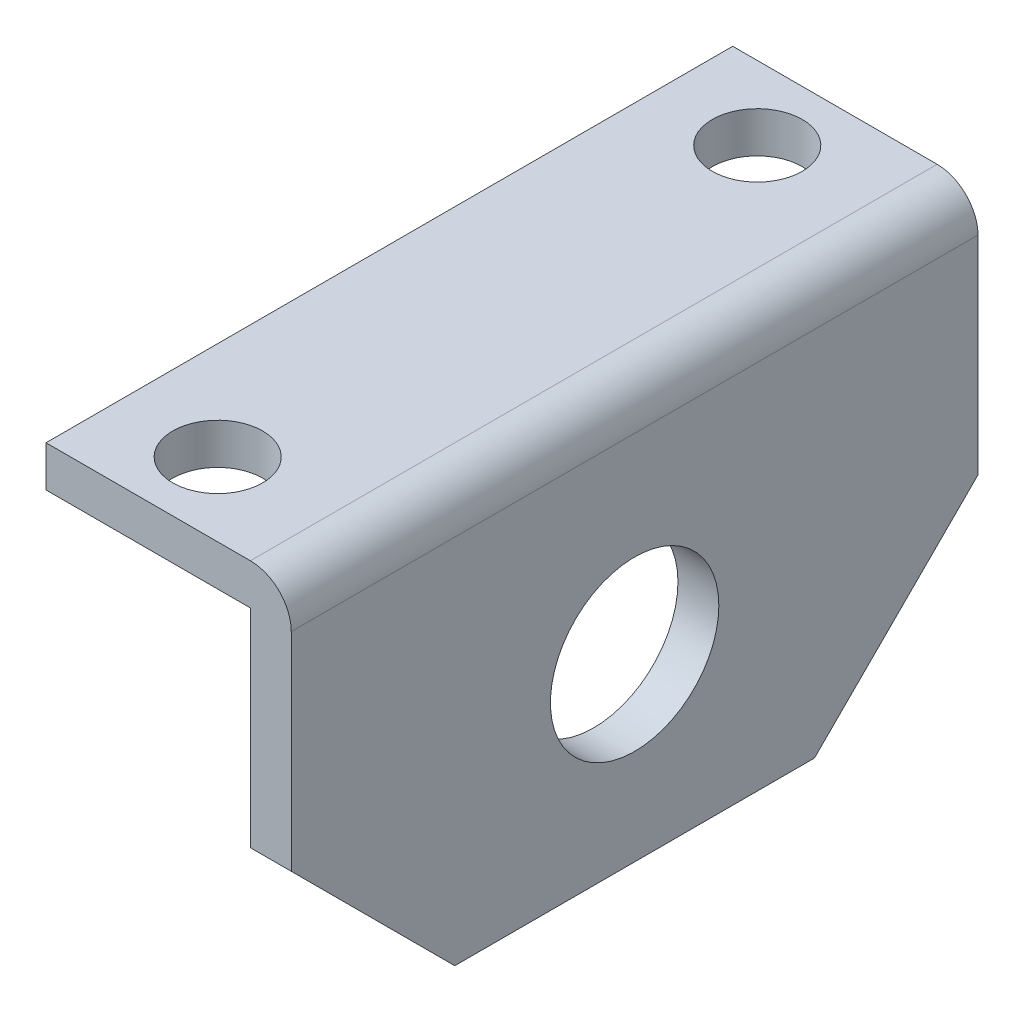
ISO-10303-21;
HEADER;
FILE_DESCRIPTION(('STEP AP214'),'2;1');
FILE_NAME('part.step','',(''),(''),'','','');
FILE_SCHEMA(('AUTOMOTIVE_DESIGN { 1 0 10303 214 1 1 1 1 }'));
ENDSEC;
DATA;
#1=APPLICATION_CONTEXT('core data for automotive mechanical design processes');
#2=APPLICATION_PROTOCOL_DEFINITION('international standard','automotive_design',2000,#1);
#3=PRODUCT_CONTEXT('',#1,'mechanical');
#4=PRODUCT('Part','Part','',(#3));
#5=PRODUCT_RELATED_PRODUCT_CATEGORY('part','',(#4));
#6=PRODUCT_DEFINITION_FORMATION('','',#4);
#7=PRODUCT_DEFINITION_CONTEXT('part definition',#1,'design');
#8=PRODUCT_DEFINITION('design','',#6,#7);
#9=PRODUCT_DEFINITION_SHAPE('','',#8);
#10=(LENGTH_UNIT() NAMED_UNIT(*) SI_UNIT(.MILLI.,.METRE.));
#11=(NAMED_UNIT(*) PLANE_ANGLE_UNIT() SI_UNIT($,.RADIAN.));
#12=(NAMED_UNIT(*) SI_UNIT($,.STERADIAN.) SOLID_ANGLE_UNIT());
#13=UNCERTAINTY_MEASURE_WITH_UNIT(LENGTH_MEASURE(1.E-05),#10,'distance_accuracy_value','');
#14=(GEOMETRIC_REPRESENTATION_CONTEXT(3) GLOBAL_UNCERTAINTY_ASSIGNED_CONTEXT((#13)) GLOBAL_UNIT_ASSIGNED_CONTEXT((#10,
#11,#12)) REPRESENTATION_CONTEXT('',''));
#15=CARTESIAN_POINT('',(0.,0.,0.));
#16=DIRECTION('',(0.,0.,1.));
#17=DIRECTION('',(1.,0.,0.));
#18=AXIS2_PLACEMENT_3D('',#15,#16,#17);
#19=CARTESIAN_POINT('',(12.5,-2.5,42.));
#20=DIRECTION('',(1.,0.,0.));
#21=DIRECTION('',(0.,0.,-1.));
#22=AXIS2_PLACEMENT_3D('',#19,#20,#21);
#23=PLANE('',#22);
#24=CARTESIAN_POINT('',(12.5,-14.1999999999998,21.));
#25=DIRECTION('',(1.,0.,0.));
#26=DIRECTION('',(0.,0.,-1.));
#27=AXIS2_PLACEMENT_3D('',#24,#25,#26);
#28=CIRCLE('',#27,5.15);
#29=CARTESIAN_POINT('',(12.5,-14.1999999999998,15.85));
#30=VERTEX_POINT('',#29);
#31=EDGE_CURVE('E209',#30,#30,#28,.T.);
#32=ORIENTED_EDGE('',*,*,#31,.T.);
#33=EDGE_LOOP('',(#32));
#34=FACE_BOUND('',#33,.T.);
#35=DIRECTION('',(0.,-1.,0.));
#36=VECTOR('',#35,1.);
#37=CARTESIAN_POINT('',(12.5,-2.5,0.));
#38=LINE('',#37,#36);
#39=CARTESIAN_POINT('',(12.5,-2.5,0.));
#40=VERTEX_POINT('',#39);
#41=CARTESIAN_POINT('',(12.5,-15.1999999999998,0.));
#42=VERTEX_POINT('',#41);
#43=EDGE_CURVE('E139',#40,#42,#38,.T.);
#44=ORIENTED_EDGE('',*,*,#43,.T.);
#45=DIRECTION('',(0.,0.707106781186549,-0.707106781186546));
#46=VECTOR('',#45,1.);
#47=CARTESIAN_POINT('',(12.5,-25.1999999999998,10.));
#48=LINE('',#47,#46);
#49=CARTESIAN_POINT('',(12.5,-25.1999999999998,10.));
#50=VERTEX_POINT('',#49);
#51=EDGE_CURVE('E40',#42,#50,#48,.F.);
#52=ORIENTED_EDGE('',*,*,#51,.T.);
#53=DIRECTION('',(0.,0.,-1.));
#54=VECTOR('',#53,1.);
#55=CARTESIAN_POINT('',(12.5,-25.1999999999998,42.));
#56=LINE('',#55,#54);
#57=CARTESIAN_POINT('',(12.5,-25.1999999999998,32.));
#58=VERTEX_POINT('',#57);
#59=EDGE_CURVE('E161',#58,#50,#56,.T.);
#60=ORIENTED_EDGE('',*,*,#59,.F.);
#61=DIRECTION('',(0.,0.707106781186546,0.707106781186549));
#62=VECTOR('',#61,1.);
#63=CARTESIAN_POINT('',(12.5,-15.1999999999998,42.));
#64=LINE('',#63,#62);
#65=CARTESIAN_POINT('',(12.5,-15.1999999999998,42.));
#66=VERTEX_POINT('',#65);
#67=EDGE_CURVE('E47',#58,#66,#64,.T.);
#68=ORIENTED_EDGE('',*,*,#67,.T.);
#69=DIRECTION('',(0.,-1.,0.));
#70=VECTOR('',#69,1.);
#71=CARTESIAN_POINT('',(12.5,-2.5,42.));
#72=LINE('',#71,#70);
#73=CARTESIAN_POINT('',(12.5,-2.5,42.));
#74=VERTEX_POINT('',#73);
#75=EDGE_CURVE('E114',#74,#66,#72,.T.);
#76=ORIENTED_EDGE('',*,*,#75,.F.);
#77=DIRECTION('',(0.,0.,-1.));
#78=VECTOR('',#77,1.);
#79=CARTESIAN_POINT('',(12.5,-2.5,42.));
#80=LINE('',#79,#78);
#81=EDGE_CURVE('E138',#74,#40,#80,.T.);
#82=ORIENTED_EDGE('',*,*,#81,.T.);
#83=EDGE_LOOP('',(#44,#52,#60,#68,#76,#82));
#84=FACE_BOUND('',#83,.T.);
#85=ADVANCED_FACE('F32',(#34,#84),#23,.F.);
#86=CARTESIAN_POINT('',(15.,-25.1999999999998,42.));
#87=DIRECTION('',(0.,1.,0.));
#88=DIRECTION('',(0.,0.,1.));
#89=AXIS2_PLACEMENT_3D('',#86,#87,#88);
#90=PLANE('',#89);
#91=ORIENTED_EDGE('',*,*,#59,.T.);
#92=DIRECTION('',(1.,0.,0.));
#93=VECTOR('',#92,1.);
#94=CARTESIAN_POINT('',(15.,-25.1999999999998,10.));
#95=LINE('',#94,#93);
#96=CARTESIAN_POINT('',(15.,-25.1999999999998,10.));
#97=VERTEX_POINT('',#96);
#98=EDGE_CURVE('E166',#50,#97,#95,.T.);
#99=ORIENTED_EDGE('',*,*,#98,.T.);
#100=DIRECTION('',(0.,0.,-1.));
#101=VECTOR('',#100,1.);
#102=CARTESIAN_POINT('',(15.,-25.1999999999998,42.));
#103=LINE('',#102,#101);
#104=CARTESIAN_POINT('',(15.,-25.1999999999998,32.));
#105=VERTEX_POINT('',#104);
#106=EDGE_CURVE('E123',#105,#97,#103,.T.);
#107=ORIENTED_EDGE('',*,*,#106,.F.);
#108=DIRECTION('',(-1.,0.,0.));
#109=VECTOR('',#108,1.);
#110=CARTESIAN_POINT('',(12.5,-25.1999999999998,32.));
#111=LINE('',#110,#109);
#112=EDGE_CURVE('E164',#105,#58,#111,.T.);
#113=ORIENTED_EDGE('',*,*,#112,.T.);
#114=EDGE_LOOP('',(#91,#99,#107,#113));
#115=FACE_BOUND('',#114,.T.);
#116=ADVANCED_FACE('F178',(#115),#90,.F.);
#117=CARTESIAN_POINT('',(15.,-2.5,42.));
#118=DIRECTION('',(-1.,0.,0.));
#119=DIRECTION('',(0.,0.,1.));
#120=AXIS2_PLACEMENT_3D('',#117,#118,#119);
#121=PLANE('',#120);
#122=CARTESIAN_POINT('',(15.,-14.1999999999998,21.));
#123=DIRECTION('',(1.,0.,0.));
#124=DIRECTION('',(0.,0.,-1.));
#125=AXIS2_PLACEMENT_3D('',#122,#123,#124);
#126=CIRCLE('',#125,5.15);
#127=CARTESIAN_POINT('',(15.,-14.1999999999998,15.85));
#128=VERTEX_POINT('',#127);
#129=EDGE_CURVE('E212',#128,#128,#126,.T.);
#130=ORIENTED_EDGE('',*,*,#129,.F.);
#131=EDGE_LOOP('',(#130));
#132=FACE_BOUND('',#131,.T.);
#133=ORIENTED_EDGE('',*,*,#106,.T.);
#134=DIRECTION('',(0.,-0.707106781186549,0.707106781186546));
#135=VECTOR('',#134,1.);
#136=CARTESIAN_POINT('',(15.,-25.1999999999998,10.));
#137=LINE('',#136,#135);
#138=CARTESIAN_POINT('',(15.,-15.1999999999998,0.));
#139=VERTEX_POINT('',#138);
#140=EDGE_CURVE('E171',#97,#139,#137,.F.);
#141=ORIENTED_EDGE('',*,*,#140,.T.);
#142=DIRECTION('',(0.,1.,0.));
#143=VECTOR('',#142,1.);
#144=CARTESIAN_POINT('',(15.,-2.5,0.));
#145=LINE('',#144,#143);
#146=CARTESIAN_POINT('',(15.,-2.5,0.));
#147=VERTEX_POINT('',#146);
#148=EDGE_CURVE('E120',#139,#147,#145,.T.);
#149=ORIENTED_EDGE('',*,*,#148,.T.);
#150=DIRECTION('',(0.,0.,-1.));
#151=VECTOR('',#150,1.);
#152=CARTESIAN_POINT('',(15.,-2.5,42.));
#153=LINE('',#152,#151);
#154=CARTESIAN_POINT('',(15.,-2.5,42.));
#155=VERTEX_POINT('',#154);
#156=EDGE_CURVE('E117',#155,#147,#153,.T.);
#157=ORIENTED_EDGE('',*,*,#156,.F.);
#158=DIRECTION('',(0.,1.,0.));
#159=VECTOR('',#158,1.);
#160=CARTESIAN_POINT('',(15.,-2.5,42.));
#161=LINE('',#160,#159);
#162=CARTESIAN_POINT('',(15.,-15.1999999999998,42.));
#163=VERTEX_POINT('',#162);
#164=EDGE_CURVE('E106',#163,#155,#161,.T.);
#165=ORIENTED_EDGE('',*,*,#164,.F.);
#166=DIRECTION('',(0.,-0.707106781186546,-0.707106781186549));
#167=VECTOR('',#166,1.);
#168=CARTESIAN_POINT('',(15.,-15.1999999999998,42.));
#169=LINE('',#168,#167);
#170=EDGE_CURVE('E169',#163,#105,#169,.T.);
#171=ORIENTED_EDGE('',*,*,#170,.T.);
#172=EDGE_LOOP('',(#133,#141,#149,#157,#165,#171));
#173=FACE_BOUND('',#172,.T.);
#174=ADVANCED_FACE('F119',(#132,#173),#121,.F.);
#175=CARTESIAN_POINT('',(12.5,-2.5,42.));
#176=DIRECTION('',(0.,0.,-1.));
#177=DIRECTION('',(-1.,0.,0.));
#178=AXIS2_PLACEMENT_3D('',#175,#176,#177);
#179=CYLINDRICAL_SURFACE('',#178,2.5);
#180=CARTESIAN_POINT('',(12.5,-2.5,0.));
#181=DIRECTION('',(0.,0.,1.));
#182=DIRECTION('',(1.,0.,0.));
#183=AXIS2_PLACEMENT_3D('',#180,#181,#182);
#184=CIRCLE('',#183,2.5);
#185=CARTESIAN_POINT('',(12.5,0.,0.));
#186=VERTEX_POINT('',#185);
#187=EDGE_CURVE('E143',#147,#186,#184,.T.);
#188=ORIENTED_EDGE('',*,*,#187,.T.);
#189=DIRECTION('',(0.,0.,-1.));
#190=VECTOR('',#189,1.);
#191=CARTESIAN_POINT('',(12.5,0.,42.));
#192=LINE('',#191,#190);
#193=CARTESIAN_POINT('',(12.5,0.,42.));
#194=VERTEX_POINT('',#193);
#195=EDGE_CURVE('E124',#194,#186,#192,.T.);
#196=ORIENTED_EDGE('',*,*,#195,.F.);
#197=CARTESIAN_POINT('',(12.5,-2.5,42.));
#198=DIRECTION('',(0.,0.,1.));
#199=DIRECTION('',(1.,0.,0.));
#200=AXIS2_PLACEMENT_3D('',#197,#198,#199);
#201=CIRCLE('',#200,2.5);
#202=EDGE_CURVE('E110',#155,#194,#201,.T.);
#203=ORIENTED_EDGE('',*,*,#202,.F.);
#204=ORIENTED_EDGE('',*,*,#156,.T.);
#205=EDGE_LOOP('',(#188,#196,#203,#204));
#206=FACE_BOUND('',#205,.T.);
#207=ADVANCED_FACE('F126',(#206),#179,.T.);
#208=CARTESIAN_POINT('',(0.,0.,42.));
#209=DIRECTION('',(0.,-1.,0.));
#210=DIRECTION('',(0.,0.,-1.));
#211=AXIS2_PLACEMENT_3D('',#208,#209,#210);
#212=PLANE('',#211);
#213=CARTESIAN_POINT('',(6.,0.,4.5));
#214=DIRECTION('',(0.,-1.,0.));
#215=DIRECTION('',(0.,0.,-1.));
#216=AXIS2_PLACEMENT_3D('',#213,#214,#215);
#217=CIRCLE('',#216,2.75);
#218=CARTESIAN_POINT('',(6.,0.,1.75));
#219=VERTEX_POINT('',#218);
#220=EDGE_CURVE('E203',#219,#219,#217,.T.);
#221=ORIENTED_EDGE('',*,*,#220,.T.);
#222=EDGE_LOOP('',(#221));
#223=FACE_BOUND('',#222,.T.);
#224=CARTESIAN_POINT('',(6.,0.,37.5));
#225=DIRECTION('',(0.,-1.,0.));
#226=DIRECTION('',(0.,0.,-1.));
#227=AXIS2_PLACEMENT_3D('',#224,#225,#226);
#228=CIRCLE('',#227,2.75);
#229=CARTESIAN_POINT('',(6.,0.,34.75));
#230=VERTEX_POINT('',#229);
#231=EDGE_CURVE('E141',#230,#230,#228,.T.);
#232=ORIENTED_EDGE('',*,*,#231,.T.);
#233=EDGE_LOOP('',(#232));
#234=FACE_BOUND('',#233,.T.);
#235=DIRECTION('',(-1.,0.,0.));
#236=VECTOR('',#235,1.);
#237=CARTESIAN_POINT('',(0.,0.,0.));
#238=LINE('',#237,#236);
#239=CARTESIAN_POINT('',(0.,0.,0.));
#240=VERTEX_POINT('',#239);
#241=EDGE_CURVE('E145',#186,#240,#238,.T.);
#242=ORIENTED_EDGE('',*,*,#241,.T.);
#243=DIRECTION('',(0.,0.,-1.));
#244=VECTOR('',#243,1.);
#245=CARTESIAN_POINT('',(0.,0.,42.));
#246=LINE('',#245,#244);
#247=CARTESIAN_POINT('',(0.,0.,42.));
#248=VERTEX_POINT('',#247);
#249=EDGE_CURVE('E156',#248,#240,#246,.T.);
#250=ORIENTED_EDGE('',*,*,#249,.F.);
#251=DIRECTION('',(-1.,0.,0.));
#252=VECTOR('',#251,1.);
#253=CARTESIAN_POINT('',(0.,0.,42.));
#254=LINE('',#253,#252);
#255=EDGE_CURVE('E129',#194,#248,#254,.T.);
#256=ORIENTED_EDGE('',*,*,#255,.F.);
#257=ORIENTED_EDGE('',*,*,#195,.T.);
#258=EDGE_LOOP('',(#242,#250,#256,#257));
#259=FACE_BOUND('',#258,.T.);
#260=ADVANCED_FACE('F186',(#223,#234,#259),#212,.F.);
#261=CARTESIAN_POINT('',(0.,0.,42.));
#262=DIRECTION('',(1.,0.,0.));
#263=DIRECTION('',(0.,0.,-1.));
#264=AXIS2_PLACEMENT_3D('',#261,#262,#263);
#265=PLANE('',#264);
#266=DIRECTION('',(0.,-1.,0.));
#267=VECTOR('',#266,1.);
#268=CARTESIAN_POINT('',(0.,0.,0.));
#269=LINE('',#268,#267);
#270=CARTESIAN_POINT('',(0.,-2.5,0.));
#271=VERTEX_POINT('',#270);
#272=EDGE_CURVE('E147',#240,#271,#269,.T.);
#273=ORIENTED_EDGE('',*,*,#272,.T.);
#274=DIRECTION('',(0.,0.,-1.));
#275=VECTOR('',#274,1.);
#276=CARTESIAN_POINT('',(0.,-2.5,42.));
#277=LINE('',#276,#275);
#278=CARTESIAN_POINT('',(0.,-2.5,42.));
#279=VERTEX_POINT('',#278);
#280=EDGE_CURVE('E153',#279,#271,#277,.T.);
#281=ORIENTED_EDGE('',*,*,#280,.F.);
#282=DIRECTION('',(0.,-1.,0.));
#283=VECTOR('',#282,1.);
#284=CARTESIAN_POINT('',(0.,0.,42.));
#285=LINE('',#284,#283);
#286=EDGE_CURVE('E131',#248,#279,#285,.T.);
#287=ORIENTED_EDGE('',*,*,#286,.F.);
#288=ORIENTED_EDGE('',*,*,#249,.T.);
#289=EDGE_LOOP('',(#273,#281,#287,#288));
#290=FACE_BOUND('',#289,.T.);
#291=ADVANCED_FACE('F193',(#290),#265,.F.);
#292=CARTESIAN_POINT('',(0.,-2.5,42.));
#293=DIRECTION('',(0.,1.,0.));
#294=DIRECTION('',(0.,0.,1.));
#295=AXIS2_PLACEMENT_3D('',#292,#293,#294);
#296=PLANE('',#295);
#297=CARTESIAN_POINT('',(6.,-2.5,4.5));
#298=DIRECTION('',(0.,-1.,0.));
#299=DIRECTION('',(0.,0.,-1.));
#300=AXIS2_PLACEMENT_3D('',#297,#298,#299);
#301=CIRCLE('',#300,2.75);
#302=CARTESIAN_POINT('',(6.,-2.5,1.75));
#303=VERTEX_POINT('',#302);
#304=EDGE_CURVE('E206',#303,#303,#301,.T.);
#305=ORIENTED_EDGE('',*,*,#304,.F.);
#306=EDGE_LOOP('',(#305));
#307=FACE_BOUND('',#306,.T.);
#308=CARTESIAN_POINT('',(6.,-2.5,37.5));
#309=DIRECTION('',(0.,-1.,0.));
#310=DIRECTION('',(0.,0.,-1.));
#311=AXIS2_PLACEMENT_3D('',#308,#309,#310);
#312=CIRCLE('',#311,2.75);
#313=CARTESIAN_POINT('',(6.,-2.5,34.75));
#314=VERTEX_POINT('',#313);
#315=EDGE_CURVE('E200',#314,#314,#312,.T.);
#316=ORIENTED_EDGE('',*,*,#315,.F.);
#317=EDGE_LOOP('',(#316));
#318=FACE_BOUND('',#317,.T.);
#319=DIRECTION('',(1.,0.,0.));
#320=VECTOR('',#319,1.);
#321=CARTESIAN_POINT('',(0.,-2.5,0.));
#322=LINE('',#321,#320);
#323=EDGE_CURVE('E149',#271,#40,#322,.T.);
#324=ORIENTED_EDGE('',*,*,#323,.T.);
#325=ORIENTED_EDGE('',*,*,#81,.F.);
#326=DIRECTION('',(1.,0.,0.));
#327=VECTOR('',#326,1.);
#328=CARTESIAN_POINT('',(0.,-2.5,42.));
#329=LINE('',#328,#327);
#330=EDGE_CURVE('E136',#279,#74,#329,.T.);
#331=ORIENTED_EDGE('',*,*,#330,.F.);
#332=ORIENTED_EDGE('',*,*,#280,.T.);
#333=EDGE_LOOP('',(#324,#325,#331,#332));
#334=FACE_BOUND('',#333,.T.);
#335=ADVANCED_FACE('F196',(#307,#318,#334),#296,.F.);
#336=CARTESIAN_POINT('',(12.5,-2.5,42.));
#337=DIRECTION('',(0.,0.,1.));
#338=DIRECTION('',(1.,0.,0.));
#339=AXIS2_PLACEMENT_3D('',#336,#337,#338);
#340=PLANE('',#339);
#341=ORIENTED_EDGE('',*,*,#75,.T.);
#342=DIRECTION('',(1.,0.,0.));
#343=VECTOR('',#342,1.);
#344=CARTESIAN_POINT('',(15.,-15.1999999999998,42.));
#345=LINE('',#344,#343);
#346=EDGE_CURVE('E11',#66,#163,#345,.T.);
#347=ORIENTED_EDGE('',*,*,#346,.T.);
#348=ORIENTED_EDGE('',*,*,#164,.T.);
#349=ORIENTED_EDGE('',*,*,#202,.T.);
#350=ORIENTED_EDGE('',*,*,#255,.T.);
#351=ORIENTED_EDGE('',*,*,#286,.T.);
#352=ORIENTED_EDGE('',*,*,#330,.T.);
#353=EDGE_LOOP('',(#341,#347,#348,#349,#350,#351,#352));
#354=FACE_BOUND('',#353,.T.);
#355=ADVANCED_FACE('F108',(#354),#340,.T.);
#356=CARTESIAN_POINT('',(12.5,-2.5,0.));
#357=DIRECTION('',(0.,0.,1.));
#358=DIRECTION('',(1.,0.,0.));
#359=AXIS2_PLACEMENT_3D('',#356,#357,#358);
#360=PLANE('',#359);
#361=ORIENTED_EDGE('',*,*,#148,.F.);
#362=DIRECTION('',(-1.,0.,0.));
#363=VECTOR('',#362,1.);
#364=CARTESIAN_POINT('',(12.5,-15.1999999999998,0.));
#365=LINE('',#364,#363);
#366=EDGE_CURVE('E55',#139,#42,#365,.T.);
#367=ORIENTED_EDGE('',*,*,#366,.T.);
#368=ORIENTED_EDGE('',*,*,#43,.F.);
#369=ORIENTED_EDGE('',*,*,#323,.F.);
#370=ORIENTED_EDGE('',*,*,#272,.F.);
#371=ORIENTED_EDGE('',*,*,#241,.F.);
#372=ORIENTED_EDGE('',*,*,#187,.F.);
#373=EDGE_LOOP('',(#361,#367,#368,#369,#370,#371,#372));
#374=FACE_BOUND('',#373,.T.);
#375=ADVANCED_FACE('F182',(#374),#360,.F.);
#376=CARTESIAN_POINT('',(6.,39.5,37.5));
#377=DIRECTION('',(0.,-1.,0.));
#378=DIRECTION('',(0.,0.,-1.));
#379=AXIS2_PLACEMENT_3D('',#376,#377,#378);
#380=CYLINDRICAL_SURFACE('',#379,2.75);
#381=CARTESIAN_POINT('',(6.,-2.5,34.75));
#382=CARTESIAN_POINT('',(6.,-2.47395833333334,34.75));
#383=CARTESIAN_POINT('',(6.,-2.44791666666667,34.75));
#384=CARTESIAN_POINT('',(6.,-2.39583333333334,34.75));
#385=CARTESIAN_POINT('',(6.,-2.36979166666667,34.75));
#386=CARTESIAN_POINT('',(6.,-2.31770833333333,34.75));
#387=CARTESIAN_POINT('',(6.,-2.29166666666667,34.75));
#388=CARTESIAN_POINT('',(6.,-2.23958333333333,34.75));
#389=CARTESIAN_POINT('',(6.,-2.21354166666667,34.75));
#390=CARTESIAN_POINT('',(6.,-2.16145833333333,34.75));
#391=CARTESIAN_POINT('',(6.,-2.13541666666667,34.75));
#392=CARTESIAN_POINT('',(6.,-2.08333333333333,34.75));
#393=CARTESIAN_POINT('',(6.,-2.05729166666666,34.75));
#394=CARTESIAN_POINT('',(6.,-2.00520833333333,34.75));
#395=CARTESIAN_POINT('',(6.,-1.97916666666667,34.75));
#396=CARTESIAN_POINT('',(6.,-1.92708333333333,34.75));
#397=CARTESIAN_POINT('',(6.,-1.90104166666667,34.75));
#398=CARTESIAN_POINT('',(6.,-1.84895833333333,34.75));
#399=CARTESIAN_POINT('',(6.,-1.82291666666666,34.75));
#400=CARTESIAN_POINT('',(6.,-1.77083333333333,34.75));
#401=CARTESIAN_POINT('',(6.,-1.74479166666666,34.75));
#402=CARTESIAN_POINT('',(6.,-1.69270833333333,34.75));
#403=CARTESIAN_POINT('',(6.,-1.66666666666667,34.75));
#404=CARTESIAN_POINT('',(6.,-1.61458333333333,34.75));
#405=CARTESIAN_POINT('',(6.,-1.58854166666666,34.75));
#406=CARTESIAN_POINT('',(6.,-1.53645833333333,34.75));
#407=CARTESIAN_POINT('',(6.,-1.51041666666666,34.75));
#408=CARTESIAN_POINT('',(6.,-1.45833333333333,34.75));
#409=CARTESIAN_POINT('',(6.,-1.43229166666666,34.75));
#410=CARTESIAN_POINT('',(6.,-1.38020833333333,34.75));
#411=CARTESIAN_POINT('',(6.,-1.35416666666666,34.75));
#412=CARTESIAN_POINT('',(6.,-1.30208333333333,34.75));
#413=CARTESIAN_POINT('',(6.,-1.27604166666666,34.75));
#414=CARTESIAN_POINT('',(6.,-1.22395833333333,34.75));
#415=CARTESIAN_POINT('',(6.,-1.19791666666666,34.75));
#416=CARTESIAN_POINT('',(6.,-1.14583333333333,34.75));
#417=CARTESIAN_POINT('',(6.,-1.11979166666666,34.75));
#418=CARTESIAN_POINT('',(6.,-1.06770833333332,34.75));
#419=CARTESIAN_POINT('',(6.,-1.04166666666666,34.75));
#420=CARTESIAN_POINT('',(6.,-0.989583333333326,34.75));
#421=CARTESIAN_POINT('',(6.,-0.96354166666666,34.75));
#422=CARTESIAN_POINT('',(6.,-0.911458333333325,34.75));
#423=CARTESIAN_POINT('',(6.,-0.885416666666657,34.75));
#424=CARTESIAN_POINT('',(6.,-0.833333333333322,34.75));
#425=CARTESIAN_POINT('',(6.,-0.807291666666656,34.75));
#426=CARTESIAN_POINT('',(6.,-0.755208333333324,34.75));
#427=CARTESIAN_POINT('',(6.,-0.729166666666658,34.75));
#428=CARTESIAN_POINT('',(6.,-0.677083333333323,34.75));
#429=CARTESIAN_POINT('',(6.,-0.651041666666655,34.75));
#430=CARTESIAN_POINT('',(6.,-0.598958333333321,34.75));
#431=CARTESIAN_POINT('',(6.,-0.572916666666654,34.75));
#432=CARTESIAN_POINT('',(6.,-0.520833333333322,34.75));
#433=CARTESIAN_POINT('',(6.,-0.494791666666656,34.75));
#434=CARTESIAN_POINT('',(6.,-0.442708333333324,34.75));
#435=CARTESIAN_POINT('',(6.,-0.416666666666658,34.75));
#436=CARTESIAN_POINT('',(6.,-0.364583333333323,34.75));
#437=CARTESIAN_POINT('',(6.,-0.338541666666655,34.75));
#438=CARTESIAN_POINT('',(6.,-0.28645833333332,34.75));
#439=CARTESIAN_POINT('',(6.,-0.260416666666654,34.75));
#440=CARTESIAN_POINT('',(6.,-0.208333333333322,34.75));
#441=CARTESIAN_POINT('',(6.,-0.182291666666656,34.75));
#442=CARTESIAN_POINT('',(6.,-0.130208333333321,34.75));
#443=CARTESIAN_POINT('',(6.,-0.104166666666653,34.75));
#444=CARTESIAN_POINT('',(6.,-0.0520833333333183,34.75));
#445=CARTESIAN_POINT('',(6.,-0.0260416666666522,34.75));
#446=CARTESIAN_POINT('',(6.,0.,34.75));
#447=B_SPLINE_CURVE_WITH_KNOTS('',3,(#381,#382,#383,#384,#385,#386,#387,#388,#389,#390,#391,
#392,#393,#394,#395,#396,#397,#398,#399,#400,#401,#402,#403,#404,#405,#406,#407,#408,#409,#410,
#411,#412,#413,#414,#415,#416,#417,#418,#419,#420,#421,#422,#423,#424,#425,#426,#427,#428,#429,
#430,#431,#432,#433,#434,#435,#436,#437,#438,#439,#440,#441,#442,#443,#444,#445,#446),
.UNSPECIFIED.,.F.,.F.,(4,2,2,2,2,2,2,2,2,2,2,2,2,2,2,2,2,2,2,2,2,2,2,2,2,2,2,2,2,2,2,2,4),(0.,
0.0781249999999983,0.156250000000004,0.234375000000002,0.3125,0.390625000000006,
0.468750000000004,0.546875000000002,0.625000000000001,0.703125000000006,0.781250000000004,
0.859375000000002,0.937500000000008,1.01562500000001,1.09375,1.17187500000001,1.25000000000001,
1.32812500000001,1.40625000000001,1.48437500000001,1.56250000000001,1.64062500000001,
1.71875000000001,1.79687500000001,1.87500000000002,1.95312500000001,2.03125000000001,
2.10937500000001,2.18750000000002,2.26562500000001,2.34375000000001,2.42187500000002,
2.50000000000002),.UNSPECIFIED.);
#448=EDGE_CURVE('BSEAM243',#314,#230,#447,.T.);
#449=ORIENTED_EDGE('',*,*,#315,.T.);
#450=ORIENTED_EDGE('',*,*,#231,.F.);
#451=ORIENTED_EDGE('',*,*,#448,.T.);
#452=ORIENTED_EDGE('',*,*,#448,.F.);
#453=EDGE_LOOP('',(#449,#451,#450,#452));
#454=FACE_BOUND('',#453,.T.);
#455=ADVANCED_FACE('F243',(#454),#380,.F.);
#456=CARTESIAN_POINT('',(6.,39.5,4.5));
#457=DIRECTION('',(0.,-1.,0.));
#458=DIRECTION('',(0.,0.,-1.));
#459=AXIS2_PLACEMENT_3D('',#456,#457,#458);
#460=CYLINDRICAL_SURFACE('',#459,2.75);
#461=CARTESIAN_POINT('',(6.,-2.5,1.75));
#462=CARTESIAN_POINT('',(6.,-2.47395833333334,1.75));
#463=CARTESIAN_POINT('',(6.,-2.44791666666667,1.75));
#464=CARTESIAN_POINT('',(6.,-2.39583333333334,1.75));
#465=CARTESIAN_POINT('',(6.,-2.36979166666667,1.75));
#466=CARTESIAN_POINT('',(6.,-2.31770833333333,1.75));
#467=CARTESIAN_POINT('',(6.,-2.29166666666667,1.75));
#468=CARTESIAN_POINT('',(6.,-2.23958333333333,1.75));
#469=CARTESIAN_POINT('',(6.,-2.21354166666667,1.75));
#470=CARTESIAN_POINT('',(6.,-2.16145833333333,1.75));
#471=CARTESIAN_POINT('',(6.,-2.13541666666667,1.75));
#472=CARTESIAN_POINT('',(6.,-2.08333333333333,1.75));
#473=CARTESIAN_POINT('',(6.,-2.05729166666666,1.75));
#474=CARTESIAN_POINT('',(6.,-2.00520833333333,1.75));
#475=CARTESIAN_POINT('',(6.,-1.97916666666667,1.75));
#476=CARTESIAN_POINT('',(6.,-1.92708333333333,1.75));
#477=CARTESIAN_POINT('',(6.,-1.90104166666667,1.75));
#478=CARTESIAN_POINT('',(6.,-1.84895833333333,1.75));
#479=CARTESIAN_POINT('',(6.,-1.82291666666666,1.75));
#480=CARTESIAN_POINT('',(6.,-1.77083333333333,1.75));
#481=CARTESIAN_POINT('',(6.,-1.74479166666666,1.75));
#482=CARTESIAN_POINT('',(6.,-1.69270833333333,1.75));
#483=CARTESIAN_POINT('',(6.,-1.66666666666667,1.75));
#484=CARTESIAN_POINT('',(6.,-1.61458333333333,1.75));
#485=CARTESIAN_POINT('',(6.,-1.58854166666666,1.75));
#486=CARTESIAN_POINT('',(6.,-1.53645833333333,1.75));
#487=CARTESIAN_POINT('',(6.,-1.51041666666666,1.75));
#488=CARTESIAN_POINT('',(6.,-1.45833333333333,1.75));
#489=CARTESIAN_POINT('',(6.,-1.43229166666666,1.75));
#490=CARTESIAN_POINT('',(6.,-1.38020833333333,1.75));
#491=CARTESIAN_POINT('',(6.,-1.35416666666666,1.75));
#492=CARTESIAN_POINT('',(6.,-1.30208333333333,1.75));
#493=CARTESIAN_POINT('',(6.,-1.27604166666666,1.75));
#494=CARTESIAN_POINT('',(6.,-1.22395833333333,1.75));
#495=CARTESIAN_POINT('',(6.,-1.19791666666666,1.75));
#496=CARTESIAN_POINT('',(6.,-1.14583333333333,1.75));
#497=CARTESIAN_POINT('',(6.,-1.11979166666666,1.75));
#498=CARTESIAN_POINT('',(6.,-1.06770833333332,1.75));
#499=CARTESIAN_POINT('',(6.,-1.04166666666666,1.75));
#500=CARTESIAN_POINT('',(6.,-0.989583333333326,1.75));
#501=CARTESIAN_POINT('',(6.,-0.96354166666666,1.75));
#502=CARTESIAN_POINT('',(6.,-0.911458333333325,1.75));
#503=CARTESIAN_POINT('',(6.,-0.885416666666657,1.75));
#504=CARTESIAN_POINT('',(6.,-0.833333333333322,1.75));
#505=CARTESIAN_POINT('',(6.,-0.807291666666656,1.75));
#506=CARTESIAN_POINT('',(6.,-0.755208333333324,1.75));
#507=CARTESIAN_POINT('',(6.,-0.729166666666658,1.75));
#508=CARTESIAN_POINT('',(6.,-0.677083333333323,1.75));
#509=CARTESIAN_POINT('',(6.,-0.651041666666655,1.75));
#510=CARTESIAN_POINT('',(6.,-0.598958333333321,1.75));
#511=CARTESIAN_POINT('',(6.,-0.572916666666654,1.75));
#512=CARTESIAN_POINT('',(6.,-0.520833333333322,1.75));
#513=CARTESIAN_POINT('',(6.,-0.494791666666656,1.75));
#514=CARTESIAN_POINT('',(6.,-0.442708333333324,1.75));
#515=CARTESIAN_POINT('',(6.,-0.416666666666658,1.75));
#516=CARTESIAN_POINT('',(6.,-0.364583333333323,1.75));
#517=CARTESIAN_POINT('',(6.,-0.338541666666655,1.75));
#518=CARTESIAN_POINT('',(6.,-0.28645833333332,1.75));
#519=CARTESIAN_POINT('',(6.,-0.260416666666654,1.75));
#520=CARTESIAN_POINT('',(6.,-0.208333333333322,1.75));
#521=CARTESIAN_POINT('',(6.,-0.182291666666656,1.75));
#522=CARTESIAN_POINT('',(6.,-0.130208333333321,1.75));
#523=CARTESIAN_POINT('',(6.,-0.104166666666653,1.75));
#524=CARTESIAN_POINT('',(6.,-0.0520833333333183,1.75));
#525=CARTESIAN_POINT('',(6.,-0.0260416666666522,1.75));
#526=CARTESIAN_POINT('',(6.,0.,1.75));
#527=B_SPLINE_CURVE_WITH_KNOTS('',3,(#461,#462,#463,#464,#465,#466,#467,#468,#469,#470,#471,
#472,#473,#474,#475,#476,#477,#478,#479,#480,#481,#482,#483,#484,#485,#486,#487,#488,#489,#490,
#491,#492,#493,#494,#495,#496,#497,#498,#499,#500,#501,#502,#503,#504,#505,#506,#507,#508,#509,
#510,#511,#512,#513,#514,#515,#516,#517,#518,#519,#520,#521,#522,#523,#524,#525,#526),
.UNSPECIFIED.,.F.,.F.,(4,2,2,2,2,2,2,2,2,2,2,2,2,2,2,2,2,2,2,2,2,2,2,2,2,2,2,2,2,2,2,2,4),(0.,
0.0781249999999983,0.156250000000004,0.234375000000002,0.3125,0.390625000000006,
0.468750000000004,0.546875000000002,0.625000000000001,0.703125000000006,0.781250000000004,
0.859375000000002,0.937500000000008,1.01562500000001,1.09375,1.17187500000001,1.25000000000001,
1.32812500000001,1.40625000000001,1.48437500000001,1.56250000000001,1.64062500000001,
1.71875000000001,1.79687500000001,1.87500000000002,1.95312500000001,2.03125000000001,
2.10937500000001,2.18750000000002,2.26562500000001,2.34375000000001,2.42187500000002,
2.50000000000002),.UNSPECIFIED.);
#528=EDGE_CURVE('BSEAM238',#303,#219,#527,.T.);
#529=ORIENTED_EDGE('',*,*,#304,.T.);
#530=ORIENTED_EDGE('',*,*,#220,.F.);
#531=ORIENTED_EDGE('',*,*,#528,.T.);
#532=ORIENTED_EDGE('',*,*,#528,.F.);
#533=EDGE_LOOP('',(#529,#531,#530,#532));
#534=FACE_BOUND('',#533,.T.);
#535=ADVANCED_FACE('F238',(#534),#460,.F.);
#536=CARTESIAN_POINT('',(-27.,-14.1999999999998,21.));
#537=DIRECTION('',(1.,0.,0.));
#538=DIRECTION('',(0.,0.,-1.));
#539=AXIS2_PLACEMENT_3D('',#536,#537,#538);
#540=CYLINDRICAL_SURFACE('',#539,5.15);
#541=CARTESIAN_POINT('',(15.,-14.1999999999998,15.85));
#542=CARTESIAN_POINT('',(14.9739583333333,-14.1999999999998,15.85));
#543=CARTESIAN_POINT('',(14.9479166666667,-14.1999999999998,15.85));
#544=CARTESIAN_POINT('',(14.8958333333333,-14.1999999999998,15.85));
#545=CARTESIAN_POINT('',(14.8697916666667,-14.1999999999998,15.85));
#546=CARTESIAN_POINT('',(14.8177083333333,-14.1999999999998,15.85));
#547=CARTESIAN_POINT('',(14.7916666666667,-14.1999999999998,15.85));
#548=CARTESIAN_POINT('',(14.7395833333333,-14.1999999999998,15.85));
#549=CARTESIAN_POINT('',(14.7135416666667,-14.1999999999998,15.85));
#550=CARTESIAN_POINT('',(14.6614583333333,-14.1999999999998,15.85));
#551=CARTESIAN_POINT('',(14.6354166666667,-14.1999999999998,15.85));
#552=CARTESIAN_POINT('',(14.5833333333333,-14.1999999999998,15.85));
#553=CARTESIAN_POINT('',(14.5572916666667,-14.1999999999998,15.85));
#554=CARTESIAN_POINT('',(14.5052083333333,-14.1999999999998,15.85));
#555=CARTESIAN_POINT('',(14.4791666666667,-14.1999999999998,15.85));
#556=CARTESIAN_POINT('',(14.4270833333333,-14.1999999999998,15.85));
#557=CARTESIAN_POINT('',(14.4010416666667,-14.1999999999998,15.85));
#558=CARTESIAN_POINT('',(14.3489583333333,-14.1999999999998,15.85));
#559=CARTESIAN_POINT('',(14.3229166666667,-14.1999999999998,15.85));
#560=CARTESIAN_POINT('',(14.2708333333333,-14.1999999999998,15.85));
#561=CARTESIAN_POINT('',(14.2447916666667,-14.1999999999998,15.85));
#562=CARTESIAN_POINT('',(14.1927083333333,-14.1999999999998,15.85));
#563=CARTESIAN_POINT('',(14.1666666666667,-14.1999999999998,15.85));
#564=CARTESIAN_POINT('',(14.1145833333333,-14.1999999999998,15.85));
#565=CARTESIAN_POINT('',(14.0885416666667,-14.1999999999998,15.85));
#566=CARTESIAN_POINT('',(14.0364583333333,-14.1999999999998,15.85));
#567=CARTESIAN_POINT('',(14.0104166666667,-14.1999999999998,15.85));
#568=CARTESIAN_POINT('',(13.9583333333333,-14.1999999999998,15.85));
#569=CARTESIAN_POINT('',(13.9322916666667,-14.1999999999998,15.85));
#570=CARTESIAN_POINT('',(13.8802083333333,-14.1999999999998,15.85));
#571=CARTESIAN_POINT('',(13.8541666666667,-14.1999999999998,15.85));
#572=CARTESIAN_POINT('',(13.8020833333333,-14.1999999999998,15.85));
#573=CARTESIAN_POINT('',(13.7760416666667,-14.1999999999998,15.85));
#574=CARTESIAN_POINT('',(13.7239583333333,-14.1999999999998,15.85));
#575=CARTESIAN_POINT('',(13.6979166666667,-14.1999999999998,15.85));
#576=CARTESIAN_POINT('',(13.6458333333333,-14.1999999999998,15.85));
#577=CARTESIAN_POINT('',(13.6197916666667,-14.1999999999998,15.85));
#578=CARTESIAN_POINT('',(13.5677083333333,-14.1999999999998,15.85));
#579=CARTESIAN_POINT('',(13.5416666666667,-14.1999999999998,15.85));
#580=CARTESIAN_POINT('',(13.4895833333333,-14.1999999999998,15.85));
#581=CARTESIAN_POINT('',(13.4635416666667,-14.1999999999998,15.85));
#582=CARTESIAN_POINT('',(13.4114583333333,-14.1999999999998,15.85));
#583=CARTESIAN_POINT('',(13.3854166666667,-14.1999999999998,15.85));
#584=CARTESIAN_POINT('',(13.3333333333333,-14.1999999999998,15.85));
#585=CARTESIAN_POINT('',(13.3072916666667,-14.1999999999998,15.85));
#586=CARTESIAN_POINT('',(13.2552083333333,-14.1999999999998,15.85));
#587=CARTESIAN_POINT('',(13.2291666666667,-14.1999999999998,15.85));
#588=CARTESIAN_POINT('',(13.1770833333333,-14.1999999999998,15.85));
#589=CARTESIAN_POINT('',(13.1510416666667,-14.1999999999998,15.85));
#590=CARTESIAN_POINT('',(13.0989583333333,-14.1999999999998,15.85));
#591=CARTESIAN_POINT('',(13.0729166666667,-14.1999999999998,15.85));
#592=CARTESIAN_POINT('',(13.0208333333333,-14.1999999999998,15.85));
#593=CARTESIAN_POINT('',(12.9947916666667,-14.1999999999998,15.85));
#594=CARTESIAN_POINT('',(12.9427083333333,-14.1999999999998,15.85));
#595=CARTESIAN_POINT('',(12.9166666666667,-14.1999999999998,15.85));
#596=CARTESIAN_POINT('',(12.8645833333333,-14.1999999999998,15.85));
#597=CARTESIAN_POINT('',(12.8385416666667,-14.1999999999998,15.85));
#598=CARTESIAN_POINT('',(12.7864583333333,-14.1999999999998,15.85));
#599=CARTESIAN_POINT('',(12.7604166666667,-14.1999999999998,15.85));
#600=CARTESIAN_POINT('',(12.7083333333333,-14.1999999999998,15.85));
#601=CARTESIAN_POINT('',(12.6822916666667,-14.1999999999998,15.85));
#602=CARTESIAN_POINT('',(12.6302083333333,-14.1999999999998,15.85));
#603=CARTESIAN_POINT('',(12.6041666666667,-14.1999999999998,15.85));
#604=CARTESIAN_POINT('',(12.5520833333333,-14.1999999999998,15.85));
#605=CARTESIAN_POINT('',(12.5260416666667,-14.1999999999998,15.85));
#606=CARTESIAN_POINT('',(12.5,-14.1999999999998,15.85));
#607=B_SPLINE_CURVE_WITH_KNOTS('',3,(#541,#542,#543,#544,#545,#546,#547,#548,#549,#550,#551,
#552,#553,#554,#555,#556,#557,#558,#559,#560,#561,#562,#563,#564,#565,#566,#567,#568,#569,#570,
#571,#572,#573,#574,#575,#576,#577,#578,#579,#580,#581,#582,#583,#584,#585,#586,#587,#588,#589,
#590,#591,#592,#593,#594,#595,#596,#597,#598,#599,#600,#601,#602,#603,#604,#605,#606),
.UNSPECIFIED.,.F.,.F.,(4,2,2,2,2,2,2,2,2,2,2,2,2,2,2,2,2,2,2,2,2,2,2,2,2,2,2,2,2,2,2,2,4),(0.,
0.0781249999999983,0.156249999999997,0.234375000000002,0.3125,0.390624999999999,
0.468750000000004,0.546875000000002,0.625000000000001,0.703124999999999,0.781249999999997,
0.859375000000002,0.937500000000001,1.015625,1.09375,1.171875,1.25,1.328125,1.40625,1.484375,
1.5625,1.640625,1.71875,1.796875,1.875,1.953125,2.03125,2.109375,2.1875,2.265625,
2.34375000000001,2.421875,2.5),.UNSPECIFIED.);
#608=EDGE_CURVE('BSEAM216',#128,#30,#607,.T.);
#609=ORIENTED_EDGE('',*,*,#129,.T.);
#610=ORIENTED_EDGE('',*,*,#31,.F.);
#611=ORIENTED_EDGE('',*,*,#608,.T.);
#612=ORIENTED_EDGE('',*,*,#608,.F.);
#613=EDGE_LOOP('',(#609,#611,#610,#612));
#614=FACE_BOUND('',#613,.T.);
#615=ADVANCED_FACE('F216',(#614),#540,.F.);
#616=CARTESIAN_POINT('',(15.,-25.1999999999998,10.));
#617=DIRECTION('',(0.,0.707106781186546,0.707106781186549));
#618=DIRECTION('',(0.,-0.707106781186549,0.707106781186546));
#619=AXIS2_PLACEMENT_3D('',#616,#617,#618);
#620=PLANE('',#619);
#621=ORIENTED_EDGE('',*,*,#51,.F.);
#622=ORIENTED_EDGE('',*,*,#366,.F.);
#623=ORIENTED_EDGE('',*,*,#140,.F.);
#624=ORIENTED_EDGE('',*,*,#98,.F.);
#625=EDGE_LOOP('',(#621,#622,#623,#624));
#626=FACE_BOUND('',#625,.T.);
#627=ADVANCED_FACE('F181',(#626),#620,.F.);
#628=CARTESIAN_POINT('',(12.5,-15.1999999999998,42.));
#629=DIRECTION('',(0.,-0.707106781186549,0.707106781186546));
#630=DIRECTION('',(0.,-0.707106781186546,-0.707106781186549));
#631=AXIS2_PLACEMENT_3D('',#628,#629,#630);
#632=PLANE('',#631);
#633=ORIENTED_EDGE('',*,*,#67,.F.);
#634=ORIENTED_EDGE('',*,*,#112,.F.);
#635=ORIENTED_EDGE('',*,*,#170,.F.);
#636=ORIENTED_EDGE('',*,*,#346,.F.);
#637=EDGE_LOOP('',(#633,#634,#635,#636));
#638=FACE_BOUND('',#637,.T.);
#639=ADVANCED_FACE('F34',(#638),#632,.T.);
#640=CLOSED_SHELL('',(#85,#116,#174,#207,#260,#291,#335,#355,#375,#455,#535,#615,#627,#639));
#641=MANIFOLD_SOLID_BREP('B2',#640);
#642=ADVANCED_BREP_SHAPE_REPRESENTATION('',(#18,#641),#14);
#643=SHAPE_DEFINITION_REPRESENTATION(#9,#642);
ENDSEC;
END-ISO-10303-21;
